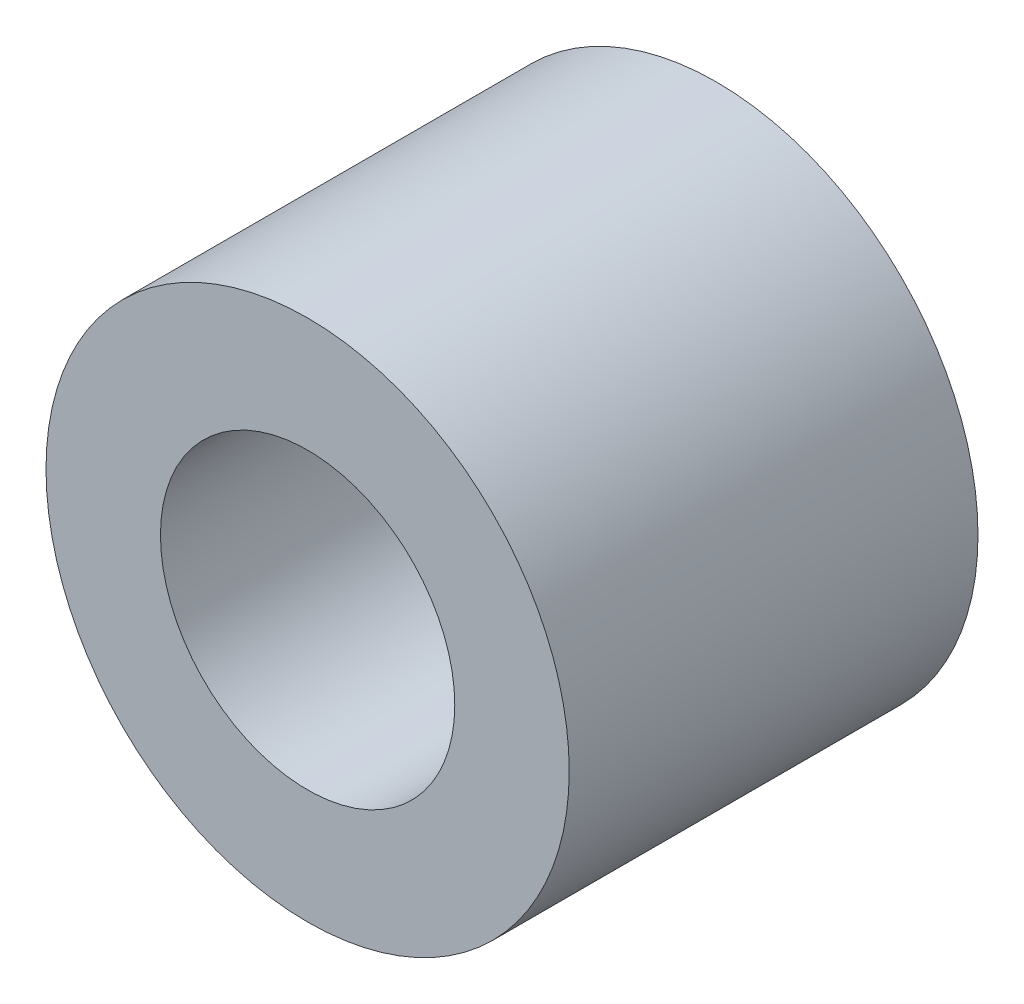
ISO-10303-21;
HEADER;
FILE_DESCRIPTION(('STEP AP214'),'2;1');
FILE_NAME('part.step','',(''),(''),'','','');
FILE_SCHEMA(('AUTOMOTIVE_DESIGN { 1 0 10303 214 1 1 1 1 }'));
ENDSEC;
DATA;
#1=APPLICATION_CONTEXT('core data for automotive mechanical design processes');
#2=APPLICATION_PROTOCOL_DEFINITION('international standard','automotive_design',2000,#1);
#3=PRODUCT_CONTEXT('',#1,'mechanical');
#4=PRODUCT('Part','Part','',(#3));
#5=PRODUCT_RELATED_PRODUCT_CATEGORY('part','',(#4));
#6=PRODUCT_DEFINITION_FORMATION('','',#4);
#7=PRODUCT_DEFINITION_CONTEXT('part definition',#1,'design');
#8=PRODUCT_DEFINITION('design','',#6,#7);
#9=PRODUCT_DEFINITION_SHAPE('','',#8);
#10=(LENGTH_UNIT() NAMED_UNIT(*) SI_UNIT(.MILLI.,.METRE.));
#11=(NAMED_UNIT(*) PLANE_ANGLE_UNIT() SI_UNIT($,.RADIAN.));
#12=(NAMED_UNIT(*) SI_UNIT($,.STERADIAN.) SOLID_ANGLE_UNIT());
#13=UNCERTAINTY_MEASURE_WITH_UNIT(LENGTH_MEASURE(1.E-05),#10,'distance_accuracy_value','');
#14=(GEOMETRIC_REPRESENTATION_CONTEXT(3) GLOBAL_UNCERTAINTY_ASSIGNED_CONTEXT((#13)) GLOBAL_UNIT_ASSIGNED_CONTEXT((#10,
#11,#12)) REPRESENTATION_CONTEXT('',''));
#15=CARTESIAN_POINT('',(0.,0.,0.));
#16=DIRECTION('',(0.,0.,1.));
#17=DIRECTION('',(1.,0.,0.));
#18=AXIS2_PLACEMENT_3D('',#15,#16,#17);
#19=CARTESIAN_POINT('',(9.,0.,9.));
#20=DIRECTION('',(0.,0.,-1.));
#21=DIRECTION('',(-1.,0.,0.));
#22=AXIS2_PLACEMENT_3D('',#19,#20,#21);
#23=PLANE('',#22);
#24=CARTESIAN_POINT('',(0.,0.,9.));
#25=DIRECTION('',(0.,0.,1.));
#26=DIRECTION('',(1.,0.,0.));
#27=AXIS2_PLACEMENT_3D('',#24,#25,#26);
#28=CIRCLE('',#27,5.5);
#29=CARTESIAN_POINT('',(5.5,0.,9.));
#30=VERTEX_POINT('',#29);
#31=EDGE_CURVE('E8',#30,#30,#28,.T.);
#32=ORIENTED_EDGE('',*,*,#31,.F.);
#33=EDGE_LOOP('',(#32));
#34=FACE_BOUND('',#33,.T.);
#35=CARTESIAN_POINT('',(0.,0.,9.));
#36=DIRECTION('',(0.,0.,1.));
#37=DIRECTION('',(1.,0.,0.));
#38=AXIS2_PLACEMENT_3D('',#35,#36,#37);
#39=CIRCLE('',#38,9.);
#40=CARTESIAN_POINT('',(9.,0.,9.));
#41=VERTEX_POINT('',#40);
#42=EDGE_CURVE('E34',#41,#41,#39,.T.);
#43=ORIENTED_EDGE('',*,*,#42,.T.);
#44=EDGE_LOOP('',(#43));
#45=FACE_BOUND('',#44,.T.);
#46=ADVANCED_FACE('F12',(#34,#45),#23,.F.);
#47=CARTESIAN_POINT('',(0.,0.,40.));
#48=DIRECTION('',(0.,0.,1.));
#49=DIRECTION('',(1.,0.,0.));
#50=AXIS2_PLACEMENT_3D('',#47,#48,#49);
#51=CYLINDRICAL_SURFACE('',#50,5.5);
#52=CARTESIAN_POINT('',(0.,0.,0.));
#53=DIRECTION('',(0.,0.,1.));
#54=DIRECTION('',(1.,0.,0.));
#55=AXIS2_PLACEMENT_3D('',#52,#53,#54);
#56=CIRCLE('',#55,5.5);
#57=CARTESIAN_POINT('',(5.5,0.,0.));
#58=VERTEX_POINT('',#57);
#59=EDGE_CURVE('E18',#58,#58,#56,.T.);
#60=ORIENTED_EDGE('',*,*,#59,.F.);
#61=EDGE_LOOP('',(#60));
#62=FACE_BOUND('',#61,.T.);
#63=ORIENTED_EDGE('',*,*,#31,.T.);
#64=EDGE_LOOP('',(#63));
#65=FACE_BOUND('',#64,.T.);
#66=ADVANCED_FACE('F59',(#62,#65),#51,.F.);
#67=CARTESIAN_POINT('',(5.5,0.,0.));
#68=DIRECTION('',(0.,0.,1.));
#69=DIRECTION('',(1.,0.,0.));
#70=AXIS2_PLACEMENT_3D('',#67,#68,#69);
#71=PLANE('',#70);
#72=CARTESIAN_POINT('',(0.,0.,0.));
#73=DIRECTION('',(0.,0.,1.));
#74=DIRECTION('',(1.,0.,0.));
#75=AXIS2_PLACEMENT_3D('',#72,#73,#74);
#76=CIRCLE('',#75,16.);
#77=CARTESIAN_POINT('',(16.,0.,0.));
#78=VERTEX_POINT('',#77);
#79=EDGE_CURVE('E22',#78,#78,#76,.T.);
#80=ORIENTED_EDGE('',*,*,#79,.F.);
#81=EDGE_LOOP('',(#80));
#82=FACE_BOUND('',#81,.T.);
#83=ORIENTED_EDGE('',*,*,#59,.T.);
#84=EDGE_LOOP('',(#83));
#85=FACE_BOUND('',#84,.T.);
#86=ADVANCED_FACE('F54',(#82,#85),#71,.F.);
#87=CARTESIAN_POINT('',(0.,0.,40.));
#88=DIRECTION('',(0.,0.,1.));
#89=DIRECTION('',(1.,0.,0.));
#90=AXIS2_PLACEMENT_3D('',#87,#88,#89);
#91=CYLINDRICAL_SURFACE('',#90,16.);
#92=CARTESIAN_POINT('',(0.,0.,25.));
#93=DIRECTION('',(0.,0.,1.));
#94=DIRECTION('',(1.,0.,0.));
#95=AXIS2_PLACEMENT_3D('',#92,#93,#94);
#96=CIRCLE('',#95,16.);
#97=CARTESIAN_POINT('',(16.,0.,25.));
#98=VERTEX_POINT('',#97);
#99=EDGE_CURVE('E26',#98,#98,#96,.T.);
#100=ORIENTED_EDGE('',*,*,#99,.F.);
#101=EDGE_LOOP('',(#100));
#102=FACE_BOUND('',#101,.T.);
#103=ORIENTED_EDGE('',*,*,#79,.T.);
#104=EDGE_LOOP('',(#103));
#105=FACE_BOUND('',#104,.T.);
#106=ADVANCED_FACE('F48',(#102,#105),#91,.T.);
#107=CARTESIAN_POINT('',(16.,0.,25.));
#108=DIRECTION('',(0.,0.,-1.));
#109=DIRECTION('',(-1.,0.,0.));
#110=AXIS2_PLACEMENT_3D('',#107,#108,#109);
#111=PLANE('',#110);
#112=CARTESIAN_POINT('',(0.,0.,25.));
#113=DIRECTION('',(0.,0.,1.));
#114=DIRECTION('',(1.,0.,0.));
#115=AXIS2_PLACEMENT_3D('',#112,#113,#114);
#116=CIRCLE('',#115,9.);
#117=CARTESIAN_POINT('',(9.,0.,25.));
#118=VERTEX_POINT('',#117);
#119=EDGE_CURVE('E31',#118,#118,#116,.T.);
#120=ORIENTED_EDGE('',*,*,#119,.F.);
#121=EDGE_LOOP('',(#120));
#122=FACE_BOUND('',#121,.T.);
#123=ORIENTED_EDGE('',*,*,#99,.T.);
#124=EDGE_LOOP('',(#123));
#125=FACE_BOUND('',#124,.T.);
#126=ADVANCED_FACE('F42',(#122,#125),#111,.F.);
#127=CARTESIAN_POINT('',(0.,0.,40.));
#128=DIRECTION('',(0.,0.,1.));
#129=DIRECTION('',(1.,0.,0.));
#130=AXIS2_PLACEMENT_3D('',#127,#128,#129);
#131=CYLINDRICAL_SURFACE('',#130,9.);
#132=ORIENTED_EDGE('',*,*,#42,.F.);
#133=EDGE_LOOP('',(#132));
#134=FACE_BOUND('',#133,.T.);
#135=ORIENTED_EDGE('',*,*,#119,.T.);
#136=EDGE_LOOP('',(#135));
#137=FACE_BOUND('',#136,.T.);
#138=ADVANCED_FACE('F39',(#134,#137),#131,.F.);
#139=CLOSED_SHELL('',(#46,#66,#86,#106,#126,#138));
#140=MANIFOLD_SOLID_BREP('B1',#139);
#141=ADVANCED_BREP_SHAPE_REPRESENTATION('',(#18,#140),#14);
#142=SHAPE_DEFINITION_REPRESENTATION(#9,#141);
ENDSEC;
END-ISO-10303-21;
